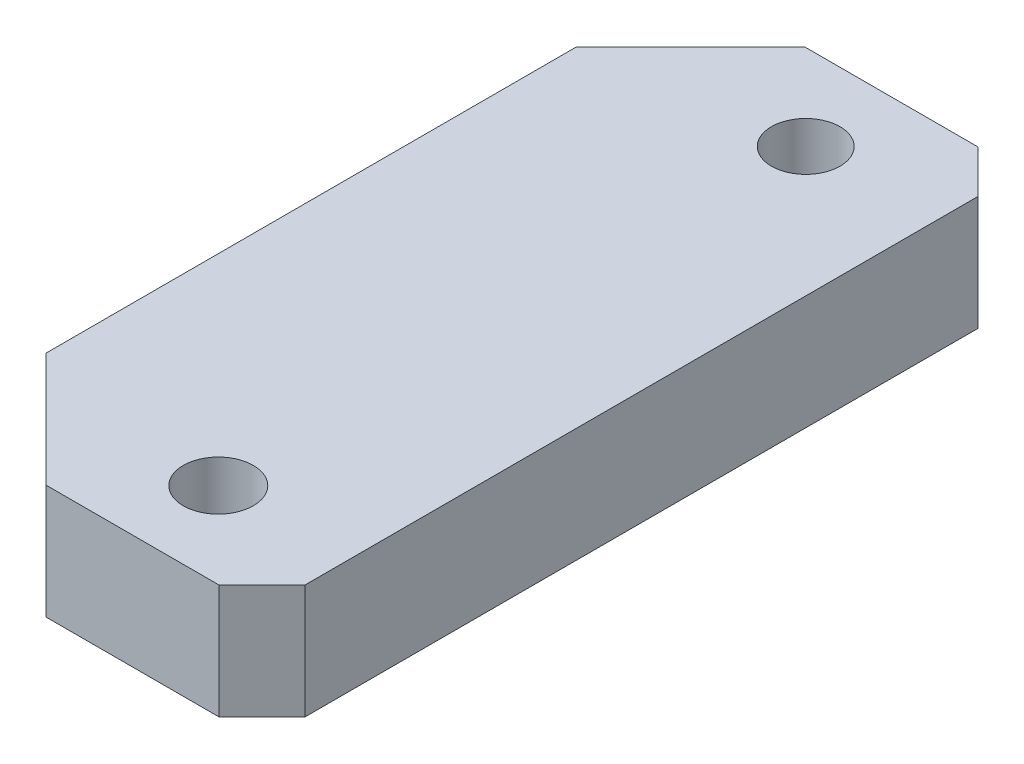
from build123d import *

# Parameters (mm, degrees)
SKETCH7_R           = 1.225493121
SKETCH7_R_2         = 1.2
BOSS_EXTRUDE5_DEPTH = 4


with BuildPart() as part:
    # Sketch7 → Boss-Extrude5 (new body)
    with BuildSketch(Plane(origin=(0, 0, 0), x_dir=(-1, 0, 0), z_dir=(0, 1, 0))):
        Polygon((37.72, 13.28), (43.78, 13.28), (47.78, 9.28), (47.78, -9.28), (43.78, -13.28), (37.72, -13.28), (36.22, -11.78), (36.22, 11.78), align=None)
        with Locations(Location((40.75, 10.28, 0), (0, 0, 90))):
            Circle(SKETCH7_R, mode=Mode.SUBTRACT)
        with Locations(Location((40.75, -10.28, 0), (0, 0, 90))):
            Circle(SKETCH7_R_2, mode=Mode.SUBTRACT)
    extrude(amount=-BOSS_EXTRUDE5_DEPTH)


solid = part.part
